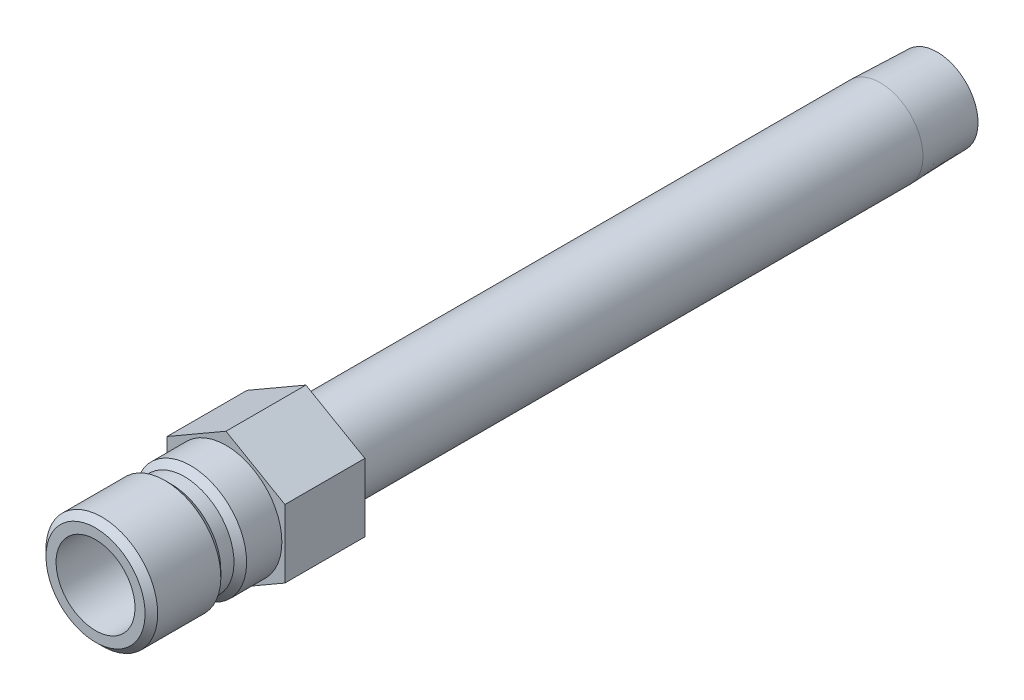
from build123d import *

# Parameters (mm, degrees)
SKETCH2_R           = 4.7625
BOSS_EXTRUDE1_DEPTH = 9.652


with BuildPart() as part:
    # Sketch1 → Revolve1 (revolve)
    with BuildSketch(Plane(origin=(0, 0, 0), x_dir=(0, 0, -1), z_dir=(1, 0, 0))):
        Polygon((-15.748, 4.7625), (-15.748, 5.9817), (-14.986, 6.7437), (-7.366, 6.7437), (-6.604, 5.9817), (-5.0165, 5.9817), (-4.2545, 6.7437), (9.652, 6.7437), (9.652, 5.1435), (78.994, 5.1435), (85.852, 4.929188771), (85.852, 3.4163), (-2.840212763, 3.4163), (-3.556, 4.7625), align=None)
    revolve(axis=Axis((0, 0, -9.652), (0, 0, 1)))

    # Sketch2 → Boss-Extrude1 (add)
    with BuildSketch(Plane.XY):
        Polygon((-7.112, 4.106115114), (-7.112, -4.106115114), (0, -8.212230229), (7.112, -4.106115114), (7.112, 4.106115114), (0, 8.212230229), align=None)
        with Locations(Location((0, 0, 0), (0, 0, 90))):
            Circle(SKETCH2_R, mode=Mode.SUBTRACT)
    extrude(amount=-BOSS_EXTRUDE1_DEPTH)


solid = part.part
